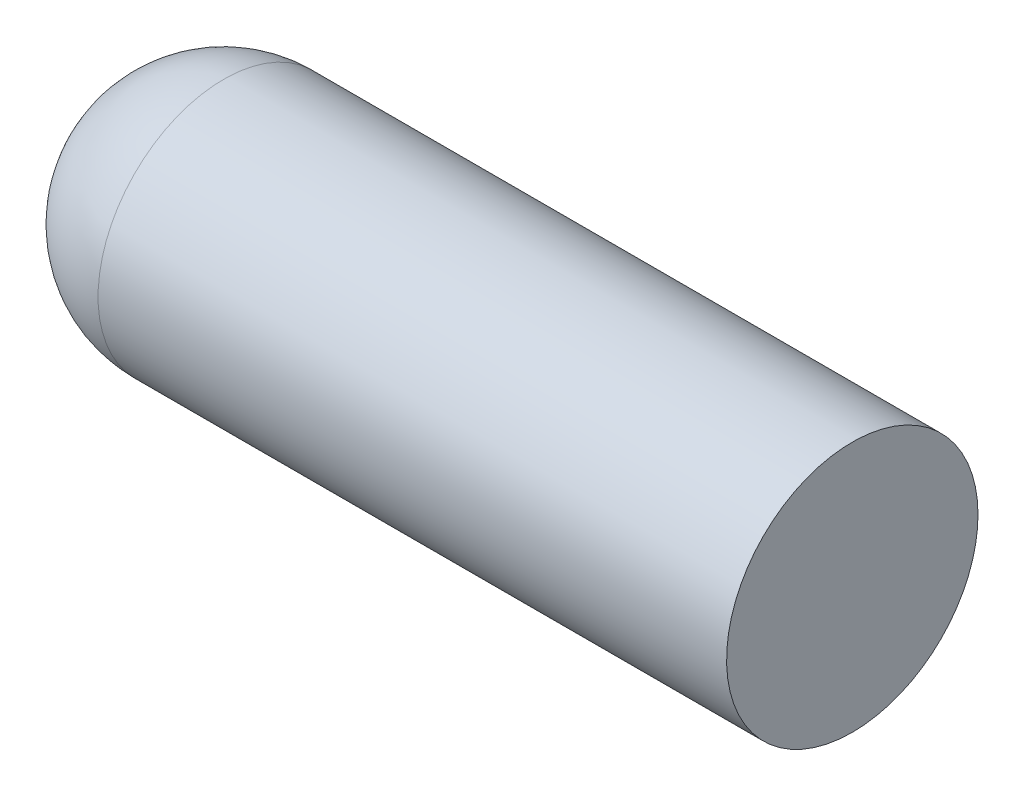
ISO-10303-21;
HEADER;
FILE_DESCRIPTION(('STEP AP214'),'2;1');
FILE_NAME('part.step','',(''),(''),'','','');
FILE_SCHEMA(('AUTOMOTIVE_DESIGN { 1 0 10303 214 1 1 1 1 }'));
ENDSEC;
DATA;
#1=APPLICATION_CONTEXT('core data for automotive mechanical design processes');
#2=APPLICATION_PROTOCOL_DEFINITION('international standard','automotive_design',2000,#1);
#3=PRODUCT_CONTEXT('',#1,'mechanical');
#4=PRODUCT('Part','Part','',(#3));
#5=PRODUCT_RELATED_PRODUCT_CATEGORY('part','',(#4));
#6=PRODUCT_DEFINITION_FORMATION('','',#4);
#7=PRODUCT_DEFINITION_CONTEXT('part definition',#1,'design');
#8=PRODUCT_DEFINITION('design','',#6,#7);
#9=PRODUCT_DEFINITION_SHAPE('','',#8);
#10=(LENGTH_UNIT() NAMED_UNIT(*) SI_UNIT(.MILLI.,.METRE.));
#11=(NAMED_UNIT(*) PLANE_ANGLE_UNIT() SI_UNIT($,.RADIAN.));
#12=(NAMED_UNIT(*) SI_UNIT($,.STERADIAN.) SOLID_ANGLE_UNIT());
#13=UNCERTAINTY_MEASURE_WITH_UNIT(LENGTH_MEASURE(1.E-05),#10,'distance_accuracy_value','');
#14=(GEOMETRIC_REPRESENTATION_CONTEXT(3) GLOBAL_UNCERTAINTY_ASSIGNED_CONTEXT((#13)) GLOBAL_UNIT_ASSIGNED_CONTEXT((#10,
#11,#12)) REPRESENTATION_CONTEXT('',''));
#15=CARTESIAN_POINT('',(0.,0.,0.));
#16=DIRECTION('',(0.,0.,1.));
#17=DIRECTION('',(1.,0.,0.));
#18=AXIS2_PLACEMENT_3D('',#15,#16,#17);
#19=CARTESIAN_POINT('',(130.345,39.8,0.));
#20=DIRECTION('',(1.,0.,0.));
#21=DIRECTION('',(0.,1.,0.));
#22=AXIS2_PLACEMENT_3D('',#19,#20,#21);
#23=CYLINDRICAL_SURFACE('',#22,1.4925);
#24=CARTESIAN_POINT('',(131.8375,39.8,0.));
#25=DIRECTION('',(1.,0.,0.));
#26=DIRECTION('',(0.,0.,-1.));
#27=AXIS2_PLACEMENT_3D('',#24,#25,#26);
#28=CIRCLE('',#27,1.4925);
#29=CARTESIAN_POINT('',(131.8375,39.8,-1.4925));
#30=VERTEX_POINT('',#29);
#31=EDGE_CURVE('E10',#30,#30,#28,.T.);
#32=ORIENTED_EDGE('',*,*,#31,.T.);
#33=EDGE_LOOP('',(#32));
#34=FACE_BOUND('',#33,.T.);
#35=CARTESIAN_POINT('',(139.3,39.8,0.));
#36=DIRECTION('',(-1.,0.,0.));
#37=DIRECTION('',(0.,-1.,0.));
#38=AXIS2_PLACEMENT_3D('',#35,#36,#37);
#39=CIRCLE('',#38,1.4925);
#40=CARTESIAN_POINT('',(139.3,38.3075,0.));
#41=VERTEX_POINT('',#40);
#42=EDGE_CURVE('E21',#41,#41,#39,.T.);
#43=ORIENTED_EDGE('',*,*,#42,.T.);
#44=EDGE_LOOP('',(#43));
#45=FACE_BOUND('',#44,.T.);
#46=ADVANCED_FACE('F14',(#34,#45),#23,.T.);
#47=CARTESIAN_POINT('',(139.3,39.8,0.));
#48=DIRECTION('',(-1.,0.,0.));
#49=DIRECTION('',(0.,-1.,0.));
#50=AXIS2_PLACEMENT_3D('',#47,#48,#49);
#51=PLANE('',#50);
#52=ORIENTED_EDGE('',*,*,#42,.F.);
#53=EDGE_LOOP('',(#52));
#54=FACE_BOUND('',#53,.T.);
#55=ADVANCED_FACE('F47',(#54),#51,.F.);
#56=CARTESIAN_POINT('',(131.8375,39.8,0.));
#57=DIRECTION('',(0.,0.,1.));
#58=DIRECTION('',(1.,0.,0.));
#59=AXIS2_PLACEMENT_3D('',#56,#57,#58);
#60=SPHERICAL_SURFACE('',#59,1.4925);
#61=CARTESIAN_POINT('',(131.8375,39.8,0.));
#62=DIRECTION('',(1.,0.,0.));
#63=DIRECTION('',(0.,0.,-1.));
#64=AXIS2_PLACEMENT_3D('',#61,#62,#63);
#65=SPHERICAL_SURFACE('',#64,1.4925);
#66=ORIENTED_EDGE('',*,*,#31,.F.);
#67=EDGE_LOOP('',(#66));
#68=FACE_BOUND('',#67,.T.);
#69=ADVANCED_FACE('F49',(#68),#65,.T.);
#70=CLOSED_SHELL('',(#46,#55,#69));
#71=MANIFOLD_SOLID_BREP('B1',#70);
#72=ADVANCED_BREP_SHAPE_REPRESENTATION('',(#18,#71),#14);
#73=SHAPE_DEFINITION_REPRESENTATION(#9,#72);
ENDSEC;
END-ISO-10303-21;
